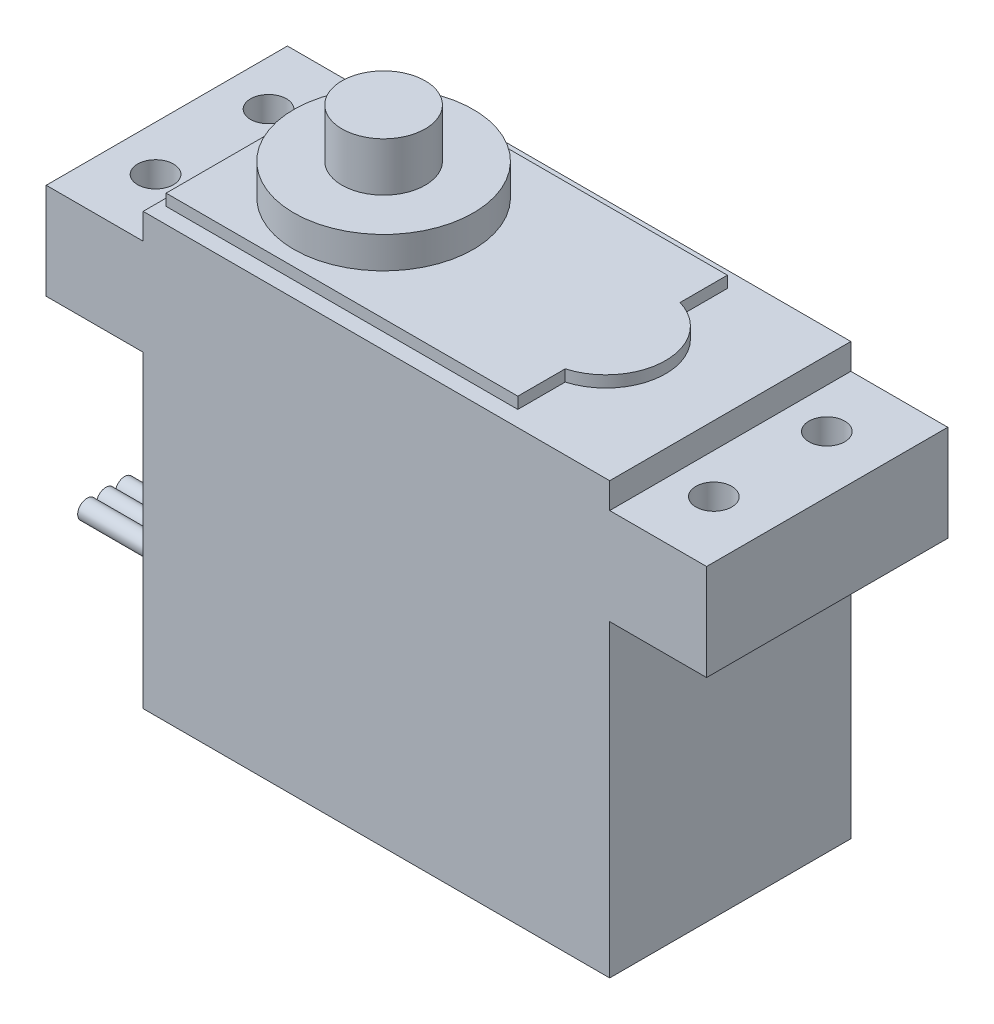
from build123d import *

# Parameters (mm, degrees)
EXTRUSION1_DEPTH        = 8.4
ESQUISSE2_R             = 1.25
ENL_V_MAT_EXTRU_1_DEPTH = 50.054688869
EXTRUSION2_DEPTH        = 0.8
ESQUISSE4_R             = 6.25
EXTRUSION3_DEPTH        = 2.2
ESQUISSE5_R             = 2.9
EXTRUSION4_DEPTH        = 3.4
ESQUISSE6_W             = 7
ESQUISSE6_H             = 4
EXTRUSION5_DEPTH        = 1
ESQUISSE7_R             = 0.65
EXTRUSION6_DEPTH        = 10


with BuildPart() as part:
    # Esquisse1 → Extrusion1 (new, symmetric)
    with BuildSketch(Plane.XY):
        Polygon((39.25, 28.2), (32.5, 28.2), (32.5, 30), (0, 30), (0, 28.2), (-6.75, 28.2), (-6.75, 21.5), (0, 21.5), (0, 0), (32.5, 0), (32.5, 21.5), (39.25, 21.5), align=None)
    extrude(amount=EXTRUSION1_DEPTH, both=True)

    # Esquisse2 → Enl_v. mat.-Extru.1 (cut, through all)
    with BuildSketch(Plane(origin=(0, 28.2, 0), x_dir=(1, 0, 0), z_dir=(0, 1, 0))):
        with Locations(Location((-3.6, -3.935, 0), (0, 0, 270))):
            Circle(ESQUISSE2_R)
        with Locations(Location((-3.6, 3.935, 0), (0, 0, 270))):
            Circle(ESQUISSE2_R)
        with Locations(Location((35.29, 3.935, 0), (0, 0, 270))):
            Circle(ESQUISSE2_R)
        with Locations(Location((35.29, -3.935, 0), (0, 0, 270))):
            Circle(ESQUISSE2_R)
    extrude(amount=-ENL_V_MAT_EXTRU_1_DEPTH, mode=Mode.SUBTRACT)

    # Esquisse3 → Extrusion2 (add)
    with BuildSketch(Plane(origin=(0, 30, 0), x_dir=(1, 0, 0), z_dir=(0, 1, 0))):
        with BuildLine():
            Line((0.5, 7.3), (25, 7.3))
            Line((25, 7.3), (25, 4))
            ThreePointArc((25, 4), (28, 0), (25, -4))
            Line((25, -4), (25, -7.3))
            Line((25, -7.3), (0.5, -7.3))
            Line((0.5, -7.3), (0.5, 7.3))
        make_face()
    extrude(amount=EXTRUSION2_DEPTH)

    # Esquisse4 → Extrusion3 (add)
    with BuildSketch(Plane(origin=(0, 30.8, 0), x_dir=(1, 0, 0), z_dir=(0, 1, 0))):
        with Locations(Location((8.35, 0, 0), (0, 0, 270))):
            Circle(ESQUISSE4_R)
    extrude(amount=EXTRUSION3_DEPTH)

    # Esquisse5 → Extrusion4 (add)
    with BuildSketch(Plane(origin=(0, 33, 0), x_dir=(1, 0, 0), z_dir=(0, 1, 0))):
        with Locations(Location((8.35, 0, 0), (0, 0, 270))):
            Circle(ESQUISSE5_R)
    extrude(amount=EXTRUSION4_DEPTH)

    # Esquisse6 → Extrusion5 (add)
    with BuildSketch(Plane.ZY):
        with Locations((0, 3)):
            Rectangle(ESQUISSE6_W, ESQUISSE6_H)
    extrude(amount=EXTRUSION5_DEPTH)

    # Esquisse9 → Lissage1 section 0
    with BuildSketch(Plane.ZY.offset(1)):
        with BuildLine():
            Line((-3, 4.5), (3, 4.5))
            Line((3, 4.5), (3, 1.5))
            Line((3, 1.5), (-3, 1.5))
            Line((-3, 1.5), (-3, 4.5))
        make_face()
    # Esquisse10 → Lissage1 section 1
    with BuildSketch(Plane.ZY.offset(5.5)):
        with BuildLine():
            Line((-2.45, 1.85), (2.45, 1.85))
            Line((2.45, 1.85), (2.45, 4.15))
            Line((2.45, 4.15), (-2.45, 4.15))
            Line((-2.45, 4.15), (-2.45, 1.85))
        make_face()
    loft()

    # Esquisse7 → Extrusion6 (add)
    with BuildSketch(Plane.ZY.offset(1)):
        with Locations(Location((-1.31, 3, 0), (0, 0, 180))):
            Circle(ESQUISSE7_R)
        with Locations(Location((0, 3, 0), (0, 0, 180))):
            Circle(ESQUISSE7_R)
        with Locations(Location((1.31, 3, 0), (0, 0, 180))):
            Circle(ESQUISSE7_R)
    extrude(amount=EXTRUSION6_DEPTH)


solid = part.part
